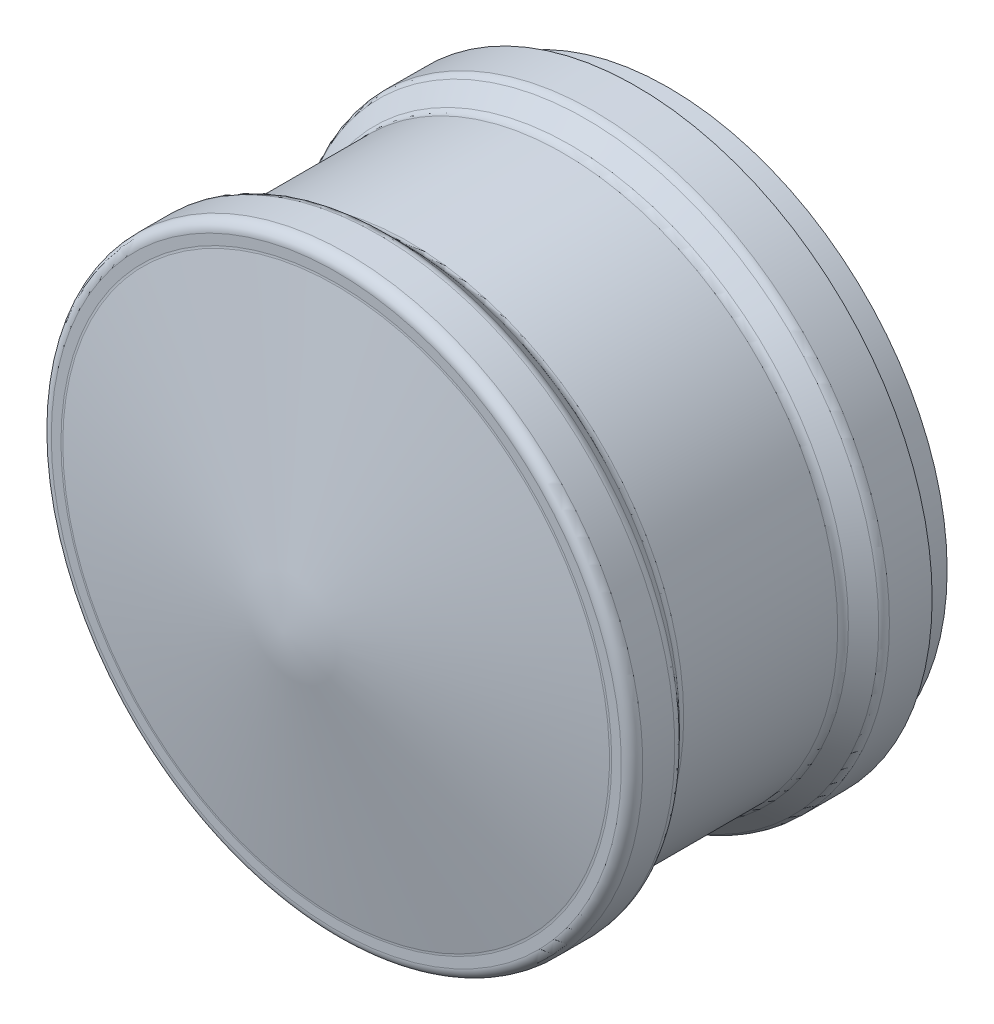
from build123d import *

# Parameters (mm, degrees)
CONG_1_R        = 0.5
CHANFREIN1_SIZE = 0.5


with BuildPart() as part:
    # Esquisse1 → Base-R_volution (revolve)
    with BuildSketch(Plane(origin=(0, 0, 0), x_dir=(0, 0, -1), z_dir=(1, 0, 0)), mode=Mode.PRIVATE) as base_r_volution_sk:
        Polygon((-15.5, 12.8), (-18, 0), (-14.8, 0), (-4.6, 8.6), (-4.6, 9.9), (-3.2, 9.9), (-3.2, 8.4), (0, 8.4), (0, 13), (-1.2, 13), (-1.2, 12.5), (-1.5, 12.5), (-1.5, 13.8), (-3.7, 13.8), (-4.7, 12.8), (-12.3, 12.8), (-13.3, 13.8), (-15.5, 13.8), align=None)
    revolve(base_r_volution_sk.sketch.rotate(Axis((0, 0, 40.156680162), (0, 0, -1)), 90), axis=Axis((0, 0, 40.156680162), (0, 0, -1)))

    # Cong_1
    cong_1_edges = [part.edges().sort_by_distance(p)[0] for p in [
        (-12.8, 0, 15.5),
        (-13.8, 0, 3.7),
        (-12.8, 0, 4.7),
        (-12.8, 0, 12.3),
        (-13.8, 0, 13.3),
        (-13.8, 0, 15.5),
    ]]
    fillet(cong_1_edges, radius=CONG_1_R)

    # Chanfrein1
    chanfrein1_edges = [part.edges().sort_by_distance(p)[0] for p in [
        (-8.4, 0, 0),
    ]]
    chamfer(chanfrein1_edges, length=CHANFREIN1_SIZE)


solid = part.part
